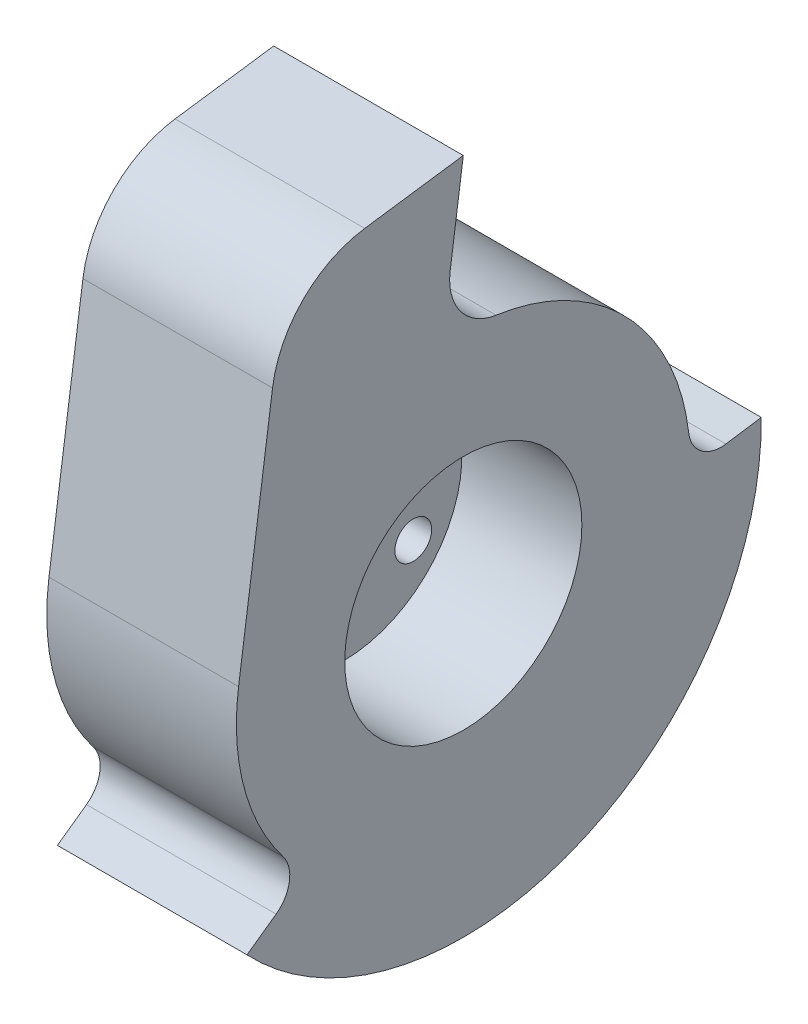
ISO-10303-21;
HEADER;
FILE_DESCRIPTION(('STEP AP214'),'2;1');
FILE_NAME('part.step','',(''),(''),'','','');
FILE_SCHEMA(('AUTOMOTIVE_DESIGN { 1 0 10303 214 1 1 1 1 }'));
ENDSEC;
DATA;
#1=APPLICATION_CONTEXT('core data for automotive mechanical design processes');
#2=APPLICATION_PROTOCOL_DEFINITION('international standard','automotive_design',2000,#1);
#3=PRODUCT_CONTEXT('',#1,'mechanical');
#4=PRODUCT('Part','Part','',(#3));
#5=PRODUCT_RELATED_PRODUCT_CATEGORY('part','',(#4));
#6=PRODUCT_DEFINITION_FORMATION('','',#4);
#7=PRODUCT_DEFINITION_CONTEXT('part definition',#1,'design');
#8=PRODUCT_DEFINITION('design','',#6,#7);
#9=PRODUCT_DEFINITION_SHAPE('','',#8);
#10=(LENGTH_UNIT() NAMED_UNIT(*) SI_UNIT(.MILLI.,.METRE.));
#11=(NAMED_UNIT(*) PLANE_ANGLE_UNIT() SI_UNIT($,.RADIAN.));
#12=(NAMED_UNIT(*) SI_UNIT($,.STERADIAN.) SOLID_ANGLE_UNIT());
#13=UNCERTAINTY_MEASURE_WITH_UNIT(LENGTH_MEASURE(1.E-05),#10,'distance_accuracy_value','');
#14=(GEOMETRIC_REPRESENTATION_CONTEXT(3) GLOBAL_UNCERTAINTY_ASSIGNED_CONTEXT((#13)) GLOBAL_UNIT_ASSIGNED_CONTEXT((#10,
#11,#12)) REPRESENTATION_CONTEXT('',''));
#15=CARTESIAN_POINT('',(0.,0.,0.));
#16=DIRECTION('',(0.,0.,1.));
#17=DIRECTION('',(1.,0.,0.));
#18=AXIS2_PLACEMENT_3D('',#15,#16,#17);
#19=CARTESIAN_POINT('',(-12.7,73.5561395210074,-59.9603590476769));
#20=DIRECTION('',(1.,0.,0.));
#21=DIRECTION('',(0.,0.,-1.));
#22=AXIS2_PLACEMENT_3D('',#19,#20,#21);
#23=PLANE('',#22);
#24=CARTESIAN_POINT('',(-12.7,49.1474223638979,-60.9398263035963));
#25=DIRECTION('',(1.,0.,0.));
#26=DIRECTION('',(0.,0.,-1.));
#27=AXIS2_PLACEMENT_3D('',#24,#25,#26);
#28=CIRCLE('',#27,4.73803297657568);
#29=CARTESIAN_POINT('',(-12.7,49.1474223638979,-65.6778592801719));
#30=VERTEX_POINT('',#29);
#31=EDGE_CURVE('E223',#30,#30,#28,.F.);
#32=ORIENTED_EDGE('',*,*,#31,.F.);
#33=EDGE_LOOP('',(#32));
#34=FACE_BOUND('',#33,.T.);
#35=CARTESIAN_POINT('',(-12.7,35.2226736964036,-63.4099223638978));
#36=DIRECTION('',(1.,0.,0.));
#37=DIRECTION('',(0.,0.,-1.));
#38=AXIS2_PLACEMENT_3D('',#35,#36,#37);
#39=CIRCLE('',#38,4.73803297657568);
#40=CARTESIAN_POINT('',(-12.7,35.2226736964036,-68.1479553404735));
#41=VERTEX_POINT('',#40);
#42=EDGE_CURVE('E226',#41,#41,#39,.F.);
#43=ORIENTED_EDGE('',*,*,#42,.F.);
#44=EDGE_LOOP('',(#43));
#45=FACE_BOUND('',#44,.T.);
#46=CARTESIAN_POINT('',(-12.7,46.6773263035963,-47.015077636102));
#47=DIRECTION('',(1.,0.,0.));
#48=DIRECTION('',(0.,0.,-1.));
#49=AXIS2_PLACEMENT_3D('',#46,#47,#48);
#50=CIRCLE('',#49,4.73803297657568);
#51=CARTESIAN_POINT('',(-12.7,46.6773263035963,-51.7531106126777));
#52=VERTEX_POINT('',#51);
#53=EDGE_CURVE('E222',#52,#52,#50,.F.);
#54=ORIENTED_EDGE('',*,*,#53,.F.);
#55=EDGE_LOOP('',(#54));
#56=FACE_BOUND('',#55,.T.);
#57=CARTESIAN_POINT('',(-12.7,40.9500000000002,-55.2124999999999));
#58=DIRECTION('',(1.,0.,0.));
#59=DIRECTION('',(0.,0.,-1.));
#60=AXIS2_PLACEMENT_3D('',#57,#58,#59);
#61=CIRCLE('',#60,2.);
#62=CARTESIAN_POINT('',(-12.7,40.9500000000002,-57.2124999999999));
#63=VERTEX_POINT('',#62);
#64=EDGE_CURVE('E242',#63,#63,#61,.T.);
#65=ORIENTED_EDGE('',*,*,#64,.T.);
#66=EDGE_LOOP('',(#65));
#67=FACE_BOUND('',#66,.T.);
#68=DIRECTION('',(0.,0.990268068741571,-0.139173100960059));
#69=VECTOR('',#68,1.);
#70=CARTESIAN_POINT('',(-12.7,85.4000000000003,-55.2124999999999));
#71=LINE('',#70,#69);
#72=CARTESIAN_POINT('',(-12.7,74.4398887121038,-53.6721568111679));
#73=VERTEX_POINT('',#72);
#74=CARTESIAN_POINT('',(-12.7,85.4000000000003,-55.2124999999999));
#75=VERTEX_POINT('',#74);
#76=EDGE_CURVE('E253',#73,#75,#71,.T.);
#77=ORIENTED_EDGE('',*,*,#76,.F.);
#78=CARTESIAN_POINT('',(-12.7,73.5561395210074,-59.9603590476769));
#79=DIRECTION('',(-1.,0.,0.));
#80=DIRECTION('',(0.,0.,-1.));
#81=AXIS2_PLACEMENT_3D('',#78,#79,#80);
#82=CIRCLE('',#81,6.35);
#83=CARTESIAN_POINT('',(-12.7,67.2724070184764,-59.0453695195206));
#84=VERTEX_POINT('',#83);
#85=EDGE_CURVE('E96',#84,#73,#82,.T.);
#86=ORIENTED_EDGE('',*,*,#85,.F.);
#87=CARTESIAN_POINT('',(-12.7,40.9500000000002,-55.2124999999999));
#88=DIRECTION('',(1.,0.,0.));
#89=DIRECTION('',(0.,0.,-1.));
#90=AXIS2_PLACEMENT_3D('',#87,#88,#89);
#91=CIRCLE('',#90,26.6);
#92=CARTESIAN_POINT('',(-12.7,44.0440042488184,-81.6319462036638));
#93=VERTEX_POINT('',#92);
#94=EDGE_CURVE('E165',#93,#84,#91,.T.);
#95=ORIENTED_EDGE('',*,*,#94,.F.);
#96=CARTESIAN_POINT('',(-12.7,44.4871680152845,-85.4160849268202));
#97=DIRECTION('',(1.,0.,0.));
#98=DIRECTION('',(0.,0.,-1.));
#99=AXIS2_PLACEMENT_3D('',#96,#97,#98);
#100=CIRCLE('',#99,3.81);
#101=CARTESIAN_POINT('',(-12.7,40.7205989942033,-85.9897205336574));
#102=VERTEX_POINT('',#101);
#103=EDGE_CURVE('E206',#93,#102,#100,.T.);
#104=ORIENTED_EDGE('',*,*,#103,.T.);
#105=DIRECTION('',(0.,0.15056052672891,-0.988600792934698));
#106=VECTOR('',#105,1.);
#107=CARTESIAN_POINT('',(-12.7,41.351939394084,-90.1351870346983));
#108=LINE('',#107,#106);
#109=CARTESIAN_POINT('',(-12.7,41.351939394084,-90.1351870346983));
#110=VERTEX_POINT('',#109);
#111=EDGE_CURVE('E139',#102,#110,#108,.T.);
#112=ORIENTED_EDGE('',*,*,#111,.T.);
#113=CARTESIAN_POINT('',(-12.7,40.9500000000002,-55.2124999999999));
#114=DIRECTION('',(1.,0.,0.));
#115=DIRECTION('',(0.,0.,-1.));
#116=AXIS2_PLACEMENT_3D('',#113,#114,#115);
#117=CIRCLE('',#116,34.9250000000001);
#118=CARTESIAN_POINT('',(-12.7,16.9321125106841,-29.857092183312));
#119=VERTEX_POINT('',#118);
#120=EDGE_CURVE('E259',#110,#119,#117,.F.);
#121=ORIENTED_EDGE('',*,*,#120,.T.);
#122=DIRECTION('',(0.,0.579967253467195,-0.814639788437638));
#123=VECTOR('',#122,1.);
#124=CARTESIAN_POINT('',(-12.7,16.9321125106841,-29.857092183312));
#125=LINE('',#124,#123);
#126=CARTESIAN_POINT('',(-12.7,19.3640697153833,-33.2730938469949));
#127=VERTEX_POINT('',#126);
#128=EDGE_CURVE('E263',#119,#127,#125,.T.);
#129=ORIENTED_EDGE('',*,*,#128,.T.);
#130=CARTESIAN_POINT('',(-12.7,22.4678473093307,-31.0634186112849));
#131=DIRECTION('',(1.,0.,0.));
#132=DIRECTION('',(0.,0.,-1.));
#133=AXIS2_PLACEMENT_3D('',#130,#131,#132);
#134=CIRCLE('',#133,3.81);
#135=CARTESIAN_POINT('',(-12.7,24.7834343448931,-34.0890023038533));
#136=VERTEX_POINT('',#135);
#137=EDGE_CURVE('E54',#127,#136,#134,.T.);
#138=ORIENTED_EDGE('',*,*,#137,.T.);
#139=CARTESIAN_POINT('',(-12.7,44.6520044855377,-28.8713693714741));
#140=VERTEX_POINT('',#139);
#141=EDGE_CURVE('E172',#140,#136,#91,.T.);
#142=ORIENTED_EDGE('',*,*,#141,.F.);
#143=DIRECTION('',(0.,-0.990268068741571,0.139173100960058));
#144=VECTOR('',#143,1.);
#145=CARTESIAN_POINT('',(-12.7,44.6520044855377,-28.8713693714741));
#146=LINE('',#145,#144);
#147=CARTESIAN_POINT('',(-12.7,72.9674612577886,-32.8508473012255));
#148=VERTEX_POINT('',#147);
#149=EDGE_CURVE('E155',#148,#140,#146,.T.);
#150=ORIENTED_EDGE('',*,*,#149,.F.);
#151=CARTESIAN_POINT('',(-12.7,71.1999628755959,-45.4272517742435));
#152=DIRECTION('',(1.,0.,0.));
#153=DIRECTION('',(0.,0.,-1.));
#154=AXIS2_PLACEMENT_3D('',#151,#152,#153);
#155=CIRCLE('',#154,12.7);
#156=CARTESIAN_POINT('',(-12.7,83.7763673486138,-43.6597533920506));
#157=VERTEX_POINT('',#156);
#158=EDGE_CURVE('E166',#157,#148,#155,.T.);
#159=ORIENTED_EDGE('',*,*,#158,.F.);
#160=DIRECTION('',(0.,-0.139173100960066,0.99026806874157));
#161=VECTOR('',#160,1.);
#162=CARTESIAN_POINT('',(-12.7,85.4000000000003,-55.2124999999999));
#163=LINE('',#162,#161);
#164=EDGE_CURVE('E252',#75,#157,#163,.T.);
#165=ORIENTED_EDGE('',*,*,#164,.F.);
#166=EDGE_LOOP('',(#77,#86,#95,#104,#112,#121,#129,#138,#142,#150,#159,#165));
#167=FACE_BOUND('',#166,.T.);
#168=CARTESIAN_POINT('',(-12.7,32.752577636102,-49.4851736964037));
#169=DIRECTION('',(1.,0.,0.));
#170=DIRECTION('',(0.,0.,-1.));
#171=AXIS2_PLACEMENT_3D('',#168,#169,#170);
#172=CIRCLE('',#171,4.73803297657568);
#173=CARTESIAN_POINT('',(-12.7,32.752577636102,-54.2232066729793));
#174=VERTEX_POINT('',#173);
#175=EDGE_CURVE('E12',#174,#174,#172,.T.);
#176=ORIENTED_EDGE('',*,*,#175,.T.);
#177=EDGE_LOOP('',(#176));
#178=FACE_BOUND('',#177,.T.);
#179=ADVANCED_FACE('F44',(#34,#45,#56,#67,#167,#178),#23,.F.);
#180=CARTESIAN_POINT('',(-52.015137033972,32.752577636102,-49.4851736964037));
#181=DIRECTION('',(1.,0.,0.));
#182=DIRECTION('',(0.,1.,0.));
#183=AXIS2_PLACEMENT_3D('',#180,#181,#182);
#184=CYLINDRICAL_SURFACE('',#183,2.159);
#185=CARTESIAN_POINT('',(-10.5359343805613,32.752577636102,-49.4851736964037));
#186=DIRECTION('',(-1.,0.,0.));
#187=DIRECTION('',(0.,0.,1.));
#188=AXIS2_PLACEMENT_3D('',#185,#186,#187);
#189=CIRCLE('',#188,2.159);
#190=CARTESIAN_POINT('',(-10.5359343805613,32.752577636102,-47.3261736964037));
#191=VERTEX_POINT('',#190);
#192=EDGE_CURVE('E219',#191,#191,#189,.F.);
#193=ORIENTED_EDGE('',*,*,#192,.F.);
#194=EDGE_LOOP('',(#193));
#195=FACE_BOUND('',#194,.T.);
#196=CARTESIAN_POINT('',(-4.5375,32.752577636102,-49.4851736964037));
#197=DIRECTION('',(-1.,0.,0.));
#198=DIRECTION('',(0.,-1.,0.));
#199=AXIS2_PLACEMENT_3D('',#196,#197,#198);
#200=CIRCLE('',#199,2.159);
#201=CARTESIAN_POINT('',(-4.5375,30.593577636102,-49.4851736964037));
#202=VERTEX_POINT('',#201);
#203=EDGE_CURVE('E212',#202,#202,#200,.T.);
#204=ORIENTED_EDGE('',*,*,#203,.F.);
#205=EDGE_LOOP('',(#204));
#206=FACE_BOUND('',#205,.T.);
#207=ADVANCED_FACE('F323',(#195,#206),#184,.F.);
#208=CARTESIAN_POINT('',(-52.015137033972,49.1474223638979,-60.9398263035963));
#209=DIRECTION('',(1.,0.,0.));
#210=DIRECTION('',(0.,1.,0.));
#211=AXIS2_PLACEMENT_3D('',#208,#209,#210);
#212=CYLINDRICAL_SURFACE('',#211,2.15900000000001);
#213=CARTESIAN_POINT('',(-10.5359343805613,49.1474223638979,-60.9398263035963));
#214=DIRECTION('',(-1.,0.,0.));
#215=DIRECTION('',(0.,0.,1.));
#216=AXIS2_PLACEMENT_3D('',#213,#214,#215);
#217=CIRCLE('',#216,2.15900000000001);
#218=CARTESIAN_POINT('',(-10.5359343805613,49.1474223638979,-58.7808263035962));
#219=VERTEX_POINT('',#218);
#220=EDGE_CURVE('E213',#219,#219,#217,.F.);
#221=ORIENTED_EDGE('',*,*,#220,.F.);
#222=EDGE_LOOP('',(#221));
#223=FACE_BOUND('',#222,.T.);
#224=CARTESIAN_POINT('',(-4.5375,49.1474223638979,-60.9398263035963));
#225=DIRECTION('',(-1.,0.,0.));
#226=DIRECTION('',(0.,-1.,0.));
#227=AXIS2_PLACEMENT_3D('',#224,#225,#226);
#228=CIRCLE('',#227,2.15900000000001);
#229=CARTESIAN_POINT('',(-4.5375,46.9884223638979,-60.9398263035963));
#230=VERTEX_POINT('',#229);
#231=EDGE_CURVE('E275',#230,#230,#228,.T.);
#232=ORIENTED_EDGE('',*,*,#231,.F.);
#233=EDGE_LOOP('',(#232));
#234=FACE_BOUND('',#233,.T.);
#235=ADVANCED_FACE('F328',(#223,#234),#212,.F.);
#236=CARTESIAN_POINT('',(12.7,40.9500000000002,-55.2124999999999));
#237=DIRECTION('',(-1.,0.,0.));
#238=DIRECTION('',(0.,0.,1.));
#239=AXIS2_PLACEMENT_3D('',#236,#237,#238);
#240=CYLINDRICAL_SURFACE('',#239,13.9);
#241=CARTESIAN_POINT('',(9.525,40.9500000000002,-55.2124999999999));
#242=DIRECTION('',(1.,0.,0.));
#243=DIRECTION('',(0.,0.,-1.));
#244=AXIS2_PLACEMENT_3D('',#241,#242,#243);
#245=CIRCLE('',#244,13.9);
#246=CARTESIAN_POINT('',(9.525,40.9500000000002,-69.1124999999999));
#247=VERTEX_POINT('',#246);
#248=EDGE_CURVE('E48',#247,#247,#245,.T.);
#249=ORIENTED_EDGE('',*,*,#248,.T.);
#250=EDGE_LOOP('',(#249));
#251=FACE_BOUND('',#250,.T.);
#252=CARTESIAN_POINT('',(-4.5375,40.9500000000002,-55.2124999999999));
#253=DIRECTION('',(-1.,0.,0.));
#254=DIRECTION('',(0.,-1.,0.));
#255=AXIS2_PLACEMENT_3D('',#252,#253,#254);
#256=CIRCLE('',#255,13.9);
#257=CARTESIAN_POINT('',(-4.5375,27.0500000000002,-55.2124999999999));
#258=VERTEX_POINT('',#257);
#259=EDGE_CURVE('E268',#258,#258,#256,.T.);
#260=ORIENTED_EDGE('',*,*,#259,.T.);
#261=EDGE_LOOP('',(#260));
#262=FACE_BOUND('',#261,.T.);
#263=ADVANCED_FACE('F286',(#251,#262),#240,.F.);
#264=CARTESIAN_POINT('',(12.7,40.9500000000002,-55.2124999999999));
#265=DIRECTION('',(-1.,0.,0.));
#266=DIRECTION('',(0.,0.,1.));
#267=AXIS2_PLACEMENT_3D('',#264,#265,#266);
#268=CYLINDRICAL_SURFACE('',#267,26.6);
#269=ORIENTED_EDGE('',*,*,#141,.T.);
#270=DIRECTION('',(-1.,0.,0.));
#271=VECTOR('',#270,1.);
#272=CARTESIAN_POINT('',(12.7,24.7834343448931,-34.0890023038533));
#273=LINE('',#272,#271);
#274=CARTESIAN_POINT('',(9.525,24.7834343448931,-34.0890023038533));
#275=VERTEX_POINT('',#274);
#276=EDGE_CURVE('E201',#136,#275,#273,.F.);
#277=ORIENTED_EDGE('',*,*,#276,.T.);
#278=CARTESIAN_POINT('',(9.525,40.9500000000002,-55.2124999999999));
#279=DIRECTION('',(1.,0.,0.));
#280=DIRECTION('',(0.,0.,-1.));
#281=AXIS2_PLACEMENT_3D('',#278,#279,#280);
#282=CIRCLE('',#281,26.6);
#283=CARTESIAN_POINT('',(9.525,44.6520044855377,-28.8713693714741));
#284=VERTEX_POINT('',#283);
#285=EDGE_CURVE('E174',#284,#275,#282,.T.);
#286=ORIENTED_EDGE('',*,*,#285,.F.);
#287=DIRECTION('',(-1.,0.,0.));
#288=VECTOR('',#287,1.);
#289=CARTESIAN_POINT('',(12.7,44.6520044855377,-28.8713693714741));
#290=LINE('',#289,#288);
#291=EDGE_CURVE('E159',#284,#140,#290,.T.);
#292=ORIENTED_EDGE('',*,*,#291,.T.);
#293=EDGE_LOOP('',(#269,#277,#286,#292));
#294=FACE_BOUND('',#293,.T.);
#295=ADVANCED_FACE('F170',(#294),#268,.T.);
#296=CARTESIAN_POINT('',(9.525,73.5561395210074,-59.9603590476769));
#297=DIRECTION('',(1.,0.,0.));
#298=DIRECTION('',(0.,0.,-1.));
#299=AXIS2_PLACEMENT_3D('',#296,#297,#298);
#300=PLANE('',#299);
#301=DIRECTION('',(0.,0.990268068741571,-0.139173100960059));
#302=VECTOR('',#301,1.);
#303=CARTESIAN_POINT('',(9.525,85.4000000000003,-55.2124999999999));
#304=LINE('',#303,#302);
#305=CARTESIAN_POINT('',(9.525,74.4398887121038,-53.6721568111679));
#306=VERTEX_POINT('',#305);
#307=CARTESIAN_POINT('',(9.525,85.4000000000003,-55.2124999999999));
#308=VERTEX_POINT('',#307);
#309=EDGE_CURVE('E182',#306,#308,#304,.T.);
#310=ORIENTED_EDGE('',*,*,#309,.T.);
#311=DIRECTION('',(0.,-0.139173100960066,0.99026806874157));
#312=VECTOR('',#311,1.);
#313=CARTESIAN_POINT('',(9.525,85.4000000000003,-55.2124999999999));
#314=LINE('',#313,#312);
#315=CARTESIAN_POINT('',(9.525,83.7763673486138,-43.6597533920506));
#316=VERTEX_POINT('',#315);
#317=EDGE_CURVE('E84',#308,#316,#314,.T.);
#318=ORIENTED_EDGE('',*,*,#317,.T.);
#319=CARTESIAN_POINT('',(9.525,71.1999628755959,-45.4272517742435));
#320=DIRECTION('',(1.,0.,0.));
#321=DIRECTION('',(0.,0.,-1.));
#322=AXIS2_PLACEMENT_3D('',#319,#320,#321);
#323=CIRCLE('',#322,12.7);
#324=CARTESIAN_POINT('',(9.525,72.9674612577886,-32.8508473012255));
#325=VERTEX_POINT('',#324);
#326=EDGE_CURVE('E247',#316,#325,#323,.T.);
#327=ORIENTED_EDGE('',*,*,#326,.T.);
#328=DIRECTION('',(0.,-0.990268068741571,0.139173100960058));
#329=VECTOR('',#328,1.);
#330=CARTESIAN_POINT('',(9.525,44.6520044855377,-28.8713693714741));
#331=LINE('',#330,#329);
#332=EDGE_CURVE('E235',#325,#284,#331,.T.);
#333=ORIENTED_EDGE('',*,*,#332,.T.);
#334=ORIENTED_EDGE('',*,*,#285,.T.);
#335=CARTESIAN_POINT('',(9.525,22.4678473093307,-31.0634186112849));
#336=DIRECTION('',(1.,0.,0.));
#337=DIRECTION('',(0.,0.,-1.));
#338=AXIS2_PLACEMENT_3D('',#335,#336,#337);
#339=CIRCLE('',#338,3.81);
#340=CARTESIAN_POINT('',(9.52499999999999,19.3640697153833,-33.2730938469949));
#341=VERTEX_POINT('',#340);
#342=EDGE_CURVE('E63',#275,#341,#339,.F.);
#343=ORIENTED_EDGE('',*,*,#342,.T.);
#344=DIRECTION('',(0.,-0.579967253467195,0.814639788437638));
#345=VECTOR('',#344,1.);
#346=CARTESIAN_POINT('',(9.525,50.2010062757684,-76.5876005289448));
#347=LINE('',#346,#345);
#348=CARTESIAN_POINT('',(9.52499999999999,16.9321125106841,-29.857092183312));
#349=VERTEX_POINT('',#348);
#350=EDGE_CURVE('E131',#341,#349,#347,.T.);
#351=ORIENTED_EDGE('',*,*,#350,.T.);
#352=CARTESIAN_POINT('',(9.52499999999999,40.9500000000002,-55.2124999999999));
#353=DIRECTION('',(1.,0.,0.));
#354=DIRECTION('',(0.,0.,-1.));
#355=AXIS2_PLACEMENT_3D('',#352,#353,#354);
#356=CIRCLE('',#355,34.9250000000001);
#357=CARTESIAN_POINT('',(9.52499999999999,41.351939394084,-90.1351870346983));
#358=VERTEX_POINT('',#357);
#359=EDGE_CURVE('E240',#349,#358,#356,.T.);
#360=ORIENTED_EDGE('',*,*,#359,.T.);
#361=DIRECTION('',(0.,-0.15056052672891,0.988600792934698));
#362=VECTOR('',#361,1.);
#363=CARTESIAN_POINT('',(9.525,37.5906095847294,-65.4377865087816));
#364=LINE('',#363,#362);
#365=CARTESIAN_POINT('',(9.52499999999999,40.7205989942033,-85.9897205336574));
#366=VERTEX_POINT('',#365);
#367=EDGE_CURVE('E237',#358,#366,#364,.T.);
#368=ORIENTED_EDGE('',*,*,#367,.T.);
#369=CARTESIAN_POINT('',(9.525,44.4871680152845,-85.4160849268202));
#370=DIRECTION('',(1.,0.,0.));
#371=DIRECTION('',(0.,0.,-1.));
#372=AXIS2_PLACEMENT_3D('',#369,#370,#371);
#373=CIRCLE('',#372,3.81);
#374=CARTESIAN_POINT('',(9.525,44.0440042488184,-81.6319462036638));
#375=VERTEX_POINT('',#374);
#376=EDGE_CURVE('E205',#366,#375,#373,.F.);
#377=ORIENTED_EDGE('',*,*,#376,.T.);
#378=CARTESIAN_POINT('',(9.525,40.9500000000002,-55.2124999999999));
#379=DIRECTION('',(1.,0.,0.));
#380=DIRECTION('',(0.,0.,-1.));
#381=AXIS2_PLACEMENT_3D('',#378,#379,#380);
#382=CIRCLE('',#381,26.6);
#383=CARTESIAN_POINT('',(9.525,67.2724070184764,-59.0453695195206));
#384=VERTEX_POINT('',#383);
#385=EDGE_CURVE('E233',#375,#384,#382,.T.);
#386=ORIENTED_EDGE('',*,*,#385,.T.);
#387=CARTESIAN_POINT('',(9.525,73.5561395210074,-59.9603590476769));
#388=DIRECTION('',(1.,0.,0.));
#389=DIRECTION('',(0.,0.,-1.));
#390=AXIS2_PLACEMENT_3D('',#387,#388,#389);
#391=CIRCLE('',#390,6.35);
#392=EDGE_CURVE('E188',#384,#306,#391,.F.);
#393=ORIENTED_EDGE('',*,*,#392,.T.);
#394=EDGE_LOOP('',(#310,#318,#327,#333,#334,#343,#351,#360,#368,#377,#386,#393));
#395=FACE_BOUND('',#394,.T.);
#396=ORIENTED_EDGE('',*,*,#248,.F.);
#397=EDGE_LOOP('',(#396));
#398=FACE_BOUND('',#397,.T.);
#399=ADVANCED_FACE('F46',(#395,#398),#300,.T.);
#400=CARTESIAN_POINT('',(12.7,85.4000000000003,-55.2124999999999));
#401=DIRECTION('',(0.,0.139173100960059,0.990268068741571));
#402=DIRECTION('',(0.,-0.990268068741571,0.139173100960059));
#403=AXIS2_PLACEMENT_3D('',#400,#401,#402);
#404=PLANE('',#403);
#405=ORIENTED_EDGE('',*,*,#76,.T.);
#406=DIRECTION('',(-1.,0.,0.));
#407=VECTOR('',#406,1.);
#408=CARTESIAN_POINT('',(12.7,85.4000000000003,-55.2124999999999));
#409=LINE('',#408,#407);
#410=EDGE_CURVE('E194',#308,#75,#409,.T.);
#411=ORIENTED_EDGE('',*,*,#410,.F.);
#412=ORIENTED_EDGE('',*,*,#309,.F.);
#413=DIRECTION('',(-1.,0.,0.));
#414=VECTOR('',#413,1.);
#415=CARTESIAN_POINT('',(12.7,74.4398887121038,-53.6721568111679));
#416=LINE('',#415,#414);
#417=EDGE_CURVE('E186',#306,#73,#416,.T.);
#418=ORIENTED_EDGE('',*,*,#417,.T.);
#419=EDGE_LOOP('',(#405,#411,#412,#418));
#420=FACE_BOUND('',#419,.T.);
#421=ADVANCED_FACE('F351',(#420),#404,.F.);
#422=CARTESIAN_POINT('',(12.7,85.4000000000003,-55.2124999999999));
#423=DIRECTION('',(0.,-0.99026806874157,-0.139173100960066));
#424=DIRECTION('',(0.,0.139173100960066,-0.99026806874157));
#425=AXIS2_PLACEMENT_3D('',#422,#423,#424);
#426=PLANE('',#425);
#427=ORIENTED_EDGE('',*,*,#164,.T.);
#428=DIRECTION('',(-1.,0.,0.));
#429=VECTOR('',#428,1.);
#430=CARTESIAN_POINT('',(12.7,83.7763673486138,-43.6597533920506));
#431=LINE('',#430,#429);
#432=EDGE_CURVE('E191',#316,#157,#431,.T.);
#433=ORIENTED_EDGE('',*,*,#432,.F.);
#434=ORIENTED_EDGE('',*,*,#317,.F.);
#435=ORIENTED_EDGE('',*,*,#410,.T.);
#436=EDGE_LOOP('',(#427,#433,#434,#435));
#437=FACE_BOUND('',#436,.T.);
#438=ADVANCED_FACE('F348',(#437),#426,.F.);
#439=CARTESIAN_POINT('',(12.7,71.1999628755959,-45.4272517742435));
#440=DIRECTION('',(-1.,0.,0.));
#441=DIRECTION('',(0.,0.,1.));
#442=AXIS2_PLACEMENT_3D('',#439,#440,#441);
#443=CYLINDRICAL_SURFACE('',#442,12.7);
#444=ORIENTED_EDGE('',*,*,#158,.T.);
#445=DIRECTION('',(-1.,0.,0.));
#446=VECTOR('',#445,1.);
#447=CARTESIAN_POINT('',(12.7,72.9674612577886,-32.8508473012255));
#448=LINE('',#447,#446);
#449=EDGE_CURVE('E162',#325,#148,#448,.T.);
#450=ORIENTED_EDGE('',*,*,#449,.F.);
#451=ORIENTED_EDGE('',*,*,#326,.F.);
#452=ORIENTED_EDGE('',*,*,#432,.T.);
#453=EDGE_LOOP('',(#444,#450,#451,#452));
#454=FACE_BOUND('',#453,.T.);
#455=ADVANCED_FACE('F251',(#454),#443,.T.);
#456=CARTESIAN_POINT('',(12.7,44.6520044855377,-28.8713693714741));
#457=DIRECTION('',(0.,-0.139173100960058,-0.990268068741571));
#458=DIRECTION('',(0.,0.990268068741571,-0.139173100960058));
#459=AXIS2_PLACEMENT_3D('',#456,#457,#458);
#460=PLANE('',#459);
#461=ORIENTED_EDGE('',*,*,#149,.T.);
#462=ORIENTED_EDGE('',*,*,#291,.F.);
#463=ORIENTED_EDGE('',*,*,#332,.F.);
#464=ORIENTED_EDGE('',*,*,#449,.T.);
#465=EDGE_LOOP('',(#461,#462,#463,#464));
#466=FACE_BOUND('',#465,.T.);
#467=ADVANCED_FACE('F157',(#466),#460,.F.);
#468=ORIENTED_EDGE('',*,*,#385,.F.);
#469=DIRECTION('',(-1.,0.,0.));
#470=VECTOR('',#469,1.);
#471=CARTESIAN_POINT('',(12.7,44.0440042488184,-81.6319462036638));
#472=LINE('',#471,#470);
#473=EDGE_CURVE('E199',#375,#93,#472,.T.);
#474=ORIENTED_EDGE('',*,*,#473,.T.);
#475=ORIENTED_EDGE('',*,*,#94,.T.);
#476=DIRECTION('',(-1.,0.,0.));
#477=VECTOR('',#476,1.);
#478=CARTESIAN_POINT('',(12.7,67.2724070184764,-59.0453695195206));
#479=LINE('',#478,#477);
#480=EDGE_CURVE('E175',#384,#84,#479,.T.);
#481=ORIENTED_EDGE('',*,*,#480,.F.);
#482=EDGE_LOOP('',(#468,#474,#475,#481));
#483=FACE_BOUND('',#482,.T.);
#484=ADVANCED_FACE('F340',(#483),#268,.T.);
#485=CARTESIAN_POINT('',(12.7,73.5561395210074,-59.9603590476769));
#486=DIRECTION('',(-1.,0.,0.));
#487=DIRECTION('',(0.,0.,1.));
#488=AXIS2_PLACEMENT_3D('',#485,#486,#487);
#489=CYLINDRICAL_SURFACE('',#488,6.35);
#490=ORIENTED_EDGE('',*,*,#85,.T.);
#491=ORIENTED_EDGE('',*,*,#417,.F.);
#492=ORIENTED_EDGE('',*,*,#392,.F.);
#493=ORIENTED_EDGE('',*,*,#480,.T.);
#494=EDGE_LOOP('',(#490,#491,#492,#493));
#495=FACE_BOUND('',#494,.T.);
#496=ADVANCED_FACE('F336',(#495),#489,.F.);
#497=CARTESIAN_POINT('',(-82.569308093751,40.9500000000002,-55.2124999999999));
#498=DIRECTION('',(1.,0.,0.));
#499=DIRECTION('',(0.,0.,-1.));
#500=AXIS2_PLACEMENT_3D('',#497,#498,#499);
#501=CYLINDRICAL_SURFACE('',#500,34.9250000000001);
#502=ORIENTED_EDGE('',*,*,#120,.F.);
#503=DIRECTION('',(1.,0.,0.));
#504=VECTOR('',#503,1.);
#505=CARTESIAN_POINT('',(-82.569308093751,41.351939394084,-90.1351870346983));
#506=LINE('',#505,#504);
#507=EDGE_CURVE('E127',#110,#358,#506,.T.);
#508=ORIENTED_EDGE('',*,*,#507,.T.);
#509=ORIENTED_EDGE('',*,*,#359,.F.);
#510=DIRECTION('',(1.,0.,0.));
#511=VECTOR('',#510,1.);
#512=CARTESIAN_POINT('',(-82.569308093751,16.9321125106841,-29.857092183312));
#513=LINE('',#512,#511);
#514=EDGE_CURVE('E261',#119,#349,#513,.T.);
#515=ORIENTED_EDGE('',*,*,#514,.F.);
#516=EDGE_LOOP('',(#502,#508,#509,#515));
#517=FACE_BOUND('',#516,.T.);
#518=ADVANCED_FACE('F339',(#517),#501,.T.);
#519=CARTESIAN_POINT('',(-82.569308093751,16.9321125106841,-29.857092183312));
#520=DIRECTION('',(0.,0.814639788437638,0.579967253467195));
#521=DIRECTION('',(0.,-0.579967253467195,0.814639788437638));
#522=AXIS2_PLACEMENT_3D('',#519,#520,#521);
#523=PLANE('',#522);
#524=ORIENTED_EDGE('',*,*,#350,.F.);
#525=DIRECTION('',(-1.,0.,0.));
#526=VECTOR('',#525,1.);
#527=CARTESIAN_POINT('',(-82.569308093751,19.3640697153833,-33.2730938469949));
#528=LINE('',#527,#526);
#529=EDGE_CURVE('E203',#341,#127,#528,.T.);
#530=ORIENTED_EDGE('',*,*,#529,.T.);
#531=ORIENTED_EDGE('',*,*,#128,.F.);
#532=ORIENTED_EDGE('',*,*,#514,.T.);
#533=EDGE_LOOP('',(#524,#530,#531,#532));
#534=FACE_BOUND('',#533,.T.);
#535=ADVANCED_FACE('F504',(#534),#523,.T.);
#536=CARTESIAN_POINT('',(-82.569308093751,41.351939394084,-90.1351870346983));
#537=DIRECTION('',(0.,0.988600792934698,0.15056052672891));
#538=DIRECTION('',(0.,-0.15056052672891,0.988600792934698));
#539=AXIS2_PLACEMENT_3D('',#536,#537,#538);
#540=PLANE('',#539);
#541=ORIENTED_EDGE('',*,*,#111,.F.);
#542=DIRECTION('',(-1.,0.,0.));
#543=VECTOR('',#542,1.);
#544=CARTESIAN_POINT('',(-82.569308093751,40.7205989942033,-85.9897205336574));
#545=LINE('',#544,#543);
#546=EDGE_CURVE('E196',#102,#366,#545,.F.);
#547=ORIENTED_EDGE('',*,*,#546,.T.);
#548=ORIENTED_EDGE('',*,*,#367,.F.);
#549=ORIENTED_EDGE('',*,*,#507,.F.);
#550=EDGE_LOOP('',(#541,#547,#548,#549));
#551=FACE_BOUND('',#550,.T.);
#552=ADVANCED_FACE('F358',(#551),#540,.T.);
#553=CARTESIAN_POINT('',(12.7,44.4871680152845,-85.4160849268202));
#554=DIRECTION('',(-1.,0.,0.));
#555=DIRECTION('',(0.,0.,1.));
#556=AXIS2_PLACEMENT_3D('',#553,#554,#555);
#557=CYLINDRICAL_SURFACE('',#556,3.81);
#558=ORIENTED_EDGE('',*,*,#103,.F.);
#559=ORIENTED_EDGE('',*,*,#473,.F.);
#560=ORIENTED_EDGE('',*,*,#376,.F.);
#561=ORIENTED_EDGE('',*,*,#546,.F.);
#562=EDGE_LOOP('',(#558,#559,#560,#561));
#563=FACE_BOUND('',#562,.T.);
#564=ADVANCED_FACE('F355',(#563),#557,.F.);
#565=CARTESIAN_POINT('',(12.7,22.4678473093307,-31.0634186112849));
#566=DIRECTION('',(-1.,0.,0.));
#567=DIRECTION('',(0.,0.,1.));
#568=AXIS2_PLACEMENT_3D('',#565,#566,#567);
#569=CYLINDRICAL_SURFACE('',#568,3.81);
#570=ORIENTED_EDGE('',*,*,#137,.F.);
#571=ORIENTED_EDGE('',*,*,#529,.F.);
#572=ORIENTED_EDGE('',*,*,#342,.F.);
#573=ORIENTED_EDGE('',*,*,#276,.F.);
#574=EDGE_LOOP('',(#570,#571,#572,#573));
#575=FACE_BOUND('',#574,.T.);
#576=ADVANCED_FACE('F292',(#575),#569,.F.);
#577=CARTESIAN_POINT('',(-4.5375,40.9500000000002,-55.2124999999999));
#578=DIRECTION('',(-1.,0.,0.));
#579=DIRECTION('',(0.,-1.,0.));
#580=AXIS2_PLACEMENT_3D('',#577,#578,#579);
#581=PLANE('',#580);
#582=ORIENTED_EDGE('',*,*,#259,.F.);
#583=EDGE_LOOP('',(#582));
#584=FACE_BOUND('',#583,.T.);
#585=ORIENTED_EDGE('',*,*,#203,.T.);
#586=EDGE_LOOP('',(#585));
#587=FACE_BOUND('',#586,.T.);
#588=CARTESIAN_POINT('',(-4.5375,35.2226736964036,-63.4099223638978));
#589=DIRECTION('',(-1.,0.,0.));
#590=DIRECTION('',(0.,-1.,0.));
#591=AXIS2_PLACEMENT_3D('',#588,#589,#590);
#592=CIRCLE('',#591,2.15899999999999);
#593=CARTESIAN_POINT('',(-4.5375,33.0636736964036,-63.4099223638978));
#594=VERTEX_POINT('',#593);
#595=EDGE_CURVE('E278',#594,#594,#592,.T.);
#596=ORIENTED_EDGE('',*,*,#595,.T.);
#597=EDGE_LOOP('',(#596));
#598=FACE_BOUND('',#597,.T.);
#599=ORIENTED_EDGE('',*,*,#231,.T.);
#600=EDGE_LOOP('',(#599));
#601=FACE_BOUND('',#600,.T.);
#602=CARTESIAN_POINT('',(-4.5375,46.6773263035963,-47.015077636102));
#603=DIRECTION('',(-1.,0.,0.));
#604=DIRECTION('',(0.,-1.,0.));
#605=AXIS2_PLACEMENT_3D('',#602,#603,#604);
#606=CIRCLE('',#605,2.159);
#607=CARTESIAN_POINT('',(-4.5375,44.5183263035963,-47.015077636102));
#608=VERTEX_POINT('',#607);
#609=EDGE_CURVE('E272',#608,#608,#606,.T.);
#610=ORIENTED_EDGE('',*,*,#609,.T.);
#611=EDGE_LOOP('',(#610));
#612=FACE_BOUND('',#611,.T.);
#613=CARTESIAN_POINT('',(-4.5375,40.9500000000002,-55.2124999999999));
#614=DIRECTION('',(-1.,0.,0.));
#615=DIRECTION('',(0.,-1.,0.));
#616=AXIS2_PLACEMENT_3D('',#613,#614,#615);
#617=CIRCLE('',#616,2.);
#618=CARTESIAN_POINT('',(-4.5375,38.9500000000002,-55.2124999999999));
#619=VERTEX_POINT('',#618);
#620=EDGE_CURVE('E269',#619,#619,#617,.T.);
#621=ORIENTED_EDGE('',*,*,#620,.T.);
#622=EDGE_LOOP('',(#621));
#623=FACE_BOUND('',#622,.T.);
#624=ADVANCED_FACE('F288',(#584,#587,#598,#601,#612,#623),#581,.F.);
#625=CARTESIAN_POINT('',(-52.015137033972,35.2226736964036,-63.4099223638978));
#626=DIRECTION('',(1.,0.,0.));
#627=DIRECTION('',(0.,1.,0.));
#628=AXIS2_PLACEMENT_3D('',#625,#626,#627);
#629=CYLINDRICAL_SURFACE('',#628,2.15899999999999);
#630=CARTESIAN_POINT('',(-10.5359343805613,35.2226736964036,-63.4099223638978));
#631=DIRECTION('',(-1.,0.,0.));
#632=DIRECTION('',(0.,0.,1.));
#633=AXIS2_PLACEMENT_3D('',#630,#631,#632);
#634=CIRCLE('',#633,2.15899999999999);
#635=CARTESIAN_POINT('',(-10.5359343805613,35.2226736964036,-61.2509223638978));
#636=VERTEX_POINT('',#635);
#637=EDGE_CURVE('E216',#636,#636,#634,.F.);
#638=ORIENTED_EDGE('',*,*,#637,.F.);
#639=EDGE_LOOP('',(#638));
#640=FACE_BOUND('',#639,.T.);
#641=ORIENTED_EDGE('',*,*,#595,.F.);
#642=EDGE_LOOP('',(#641));
#643=FACE_BOUND('',#642,.T.);
#644=ADVANCED_FACE('F291',(#640,#643),#629,.F.);
#645=CARTESIAN_POINT('',(-52.015137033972,46.6773263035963,-47.015077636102));
#646=DIRECTION('',(1.,0.,0.));
#647=DIRECTION('',(0.,1.,0.));
#648=AXIS2_PLACEMENT_3D('',#645,#646,#647);
#649=CYLINDRICAL_SURFACE('',#648,2.159);
#650=CARTESIAN_POINT('',(-10.5359343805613,46.6773263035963,-47.015077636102));
#651=DIRECTION('',(-1.,0.,0.));
#652=DIRECTION('',(0.,0.,1.));
#653=AXIS2_PLACEMENT_3D('',#650,#651,#652);
#654=CIRCLE('',#653,2.159);
#655=CARTESIAN_POINT('',(-10.5359343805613,46.6773263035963,-44.856077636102));
#656=VERTEX_POINT('',#655);
#657=EDGE_CURVE('E209',#656,#656,#654,.F.);
#658=ORIENTED_EDGE('',*,*,#657,.F.);
#659=EDGE_LOOP('',(#658));
#660=FACE_BOUND('',#659,.T.);
#661=ORIENTED_EDGE('',*,*,#609,.F.);
#662=EDGE_LOOP('',(#661));
#663=FACE_BOUND('',#662,.T.);
#664=ADVANCED_FACE('F307',(#660,#663),#649,.F.);
#665=CARTESIAN_POINT('',(-52.015137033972,40.9500000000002,-55.2124999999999));
#666=DIRECTION('',(1.,0.,0.));
#667=DIRECTION('',(0.,1.,0.));
#668=AXIS2_PLACEMENT_3D('',#665,#666,#667);
#669=CYLINDRICAL_SURFACE('',#668,2.);
#670=ORIENTED_EDGE('',*,*,#64,.F.);
#671=EDGE_LOOP('',(#670));
#672=FACE_BOUND('',#671,.T.);
#673=ORIENTED_EDGE('',*,*,#620,.F.);
#674=EDGE_LOOP('',(#673));
#675=FACE_BOUND('',#674,.T.);
#676=ADVANCED_FACE('F304',(#672,#675),#669,.F.);
#677=CARTESIAN_POINT('',(-11.6975,46.6773263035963,-47.015077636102));
#678=DIRECTION('',(-1.,0.,0.));
#679=DIRECTION('',(0.,0.,1.));
#680=AXIS2_PLACEMENT_3D('',#677,#678,#679);
#681=CONICAL_SURFACE('',#680,3.5433,0.872664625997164);
#682=ORIENTED_EDGE('',*,*,#657,.T.);
#683=EDGE_LOOP('',(#682));
#684=FACE_BOUND('',#683,.T.);
#685=ORIENTED_EDGE('',*,*,#53,.T.);
#686=EDGE_LOOP('',(#685));
#687=FACE_BOUND('',#686,.T.);
#688=ADVANCED_FACE('F306',(#684,#687),#681,.F.);
#689=CARTESIAN_POINT('',(-11.6975,49.1474223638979,-60.9398263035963));
#690=DIRECTION('',(-1.,0.,0.));
#691=DIRECTION('',(0.,0.,1.));
#692=AXIS2_PLACEMENT_3D('',#689,#690,#691);
#693=CONICAL_SURFACE('',#692,3.5433,0.872664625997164);
#694=ORIENTED_EDGE('',*,*,#220,.T.);
#695=EDGE_LOOP('',(#694));
#696=FACE_BOUND('',#695,.T.);
#697=ORIENTED_EDGE('',*,*,#31,.T.);
#698=EDGE_LOOP('',(#697));
#699=FACE_BOUND('',#698,.T.);
#700=ADVANCED_FACE('F314',(#696,#699),#693,.F.);
#701=CARTESIAN_POINT('',(-11.6975,35.2226736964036,-63.4099223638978));
#702=DIRECTION('',(-1.,0.,0.));
#703=DIRECTION('',(0.,0.,1.));
#704=AXIS2_PLACEMENT_3D('',#701,#702,#703);
#705=CONICAL_SURFACE('',#704,3.5433,0.872664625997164);
#706=ORIENTED_EDGE('',*,*,#637,.T.);
#707=EDGE_LOOP('',(#706));
#708=FACE_BOUND('',#707,.T.);
#709=ORIENTED_EDGE('',*,*,#42,.T.);
#710=EDGE_LOOP('',(#709));
#711=FACE_BOUND('',#710,.T.);
#712=ADVANCED_FACE('F365',(#708,#711),#705,.F.);
#713=CARTESIAN_POINT('',(-11.6975,32.752577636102,-49.4851736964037));
#714=DIRECTION('',(-1.,0.,0.));
#715=DIRECTION('',(0.,0.,1.));
#716=AXIS2_PLACEMENT_3D('',#713,#714,#715);
#717=CONICAL_SURFACE('',#716,3.5433,0.872664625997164);
#718=ORIENTED_EDGE('',*,*,#192,.T.);
#719=EDGE_LOOP('',(#718));
#720=FACE_BOUND('',#719,.T.);
#721=ORIENTED_EDGE('',*,*,#175,.F.);
#722=EDGE_LOOP('',(#721));
#723=FACE_BOUND('',#722,.T.);
#724=ADVANCED_FACE('F363',(#720,#723),#717,.F.);
#725=CLOSED_SHELL('',(#179,#207,#235,#263,#295,#399,#421,#438,#455,#467,#484,#496,#518,#535,
#552,#564,#576,#624,#644,#664,#676,#688,#700,#712,#724));
#726=MANIFOLD_SOLID_BREP('B2',#725);
#727=ADVANCED_BREP_SHAPE_REPRESENTATION('',(#18,#726),#14);
#728=SHAPE_DEFINITION_REPRESENTATION(#9,#727);
ENDSEC;
END-ISO-10303-21;
